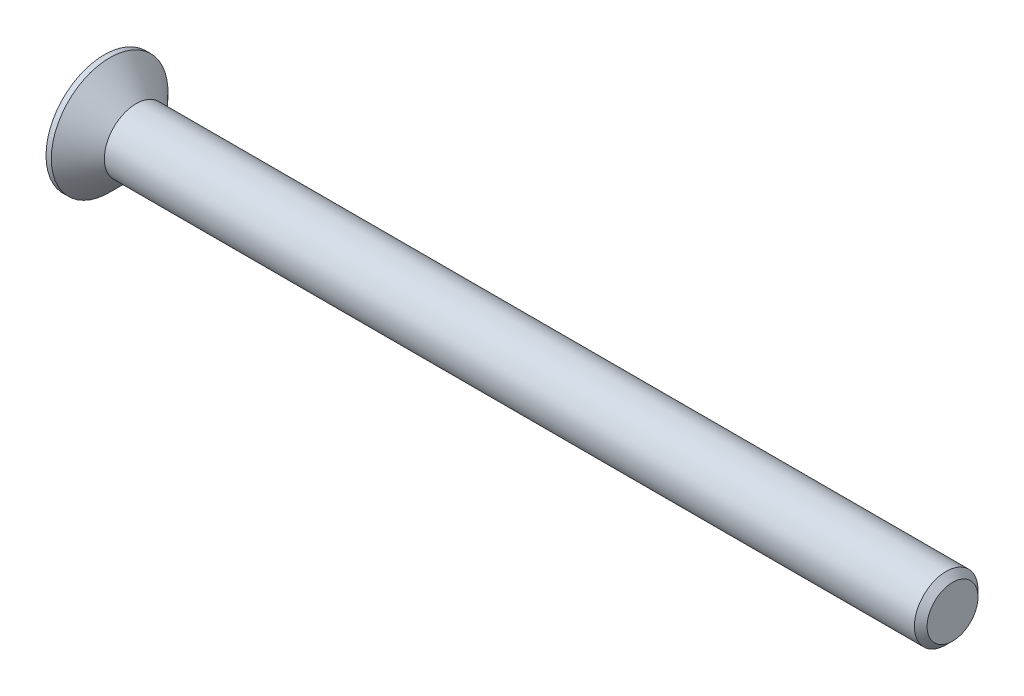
from build123d import *

# Parameters (mm, degrees)
CHAMFER1_SIZE      = 0.6
CUT_EXTRUDE1_DEPTH = 2.5


with BuildPart() as part:
    # Sketch1 → Revolve1 (revolve)
    with BuildSketch(Plane.XY, mode=Mode.PRIVATE) as revolve1_sk:
        Polygon((-3, 5.5), (-3, 0), (77, 0), (77, 3), (0, 3), (-2.5, 5.5), align=None)
    revolve(revolve1_sk.sketch.rotate(Axis((-3, 0, 0), (1, 0, 0)), 90), axis=Axis((-3, 0, 0), (1, 0, 0)))

    # Chamfer1
    chamfer1_edges = [part.edges().sort_by_distance(p)[0] for p in [
        (77, 0, -3),
    ]]
    chamfer(chamfer1_edges, length=CHAMFER1_SIZE)

    # Sketch2 → Cut-Extrude1 (cut)
    with BuildSketch(Plane.ZY.offset(3)):
        Polygon((-0.825, 3.3), (0.825, 3.3), (0.825, 0.825), (3.3, 0.825), (3.3, -0.825), (0.825, -0.825), (0.825, -3.3), (-0.825, -3.3), (-0.825, -0.825), (-3.3, -0.825), (-3.3, 0.825), (-0.825, 0.825), align=None)
    extrude(amount=-CUT_EXTRUDE1_DEPTH, mode=Mode.SUBTRACT)


solid = part.part
